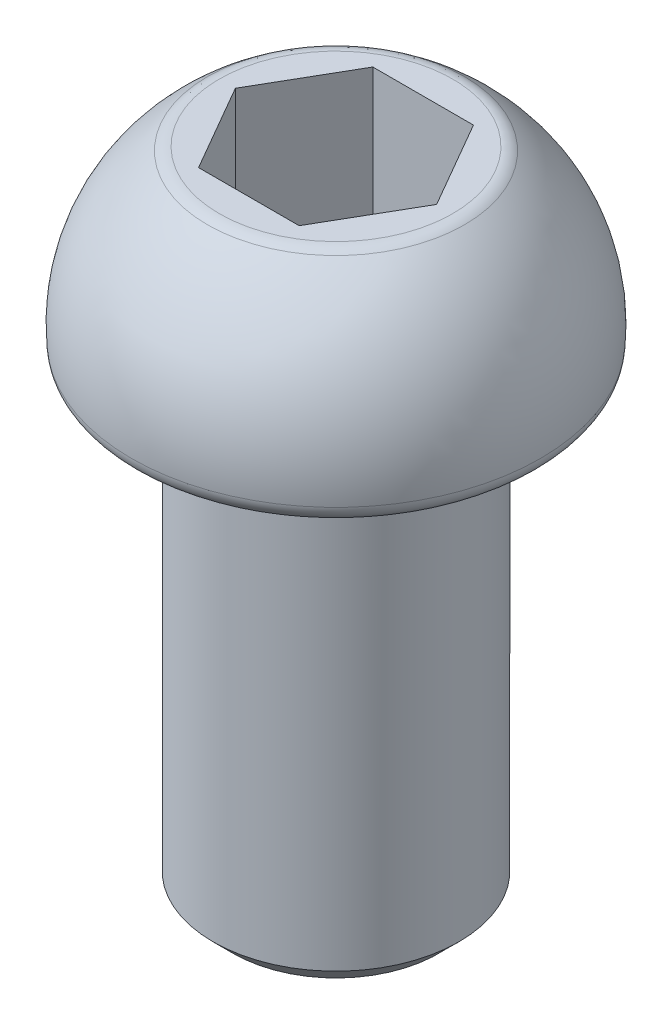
ISO-10303-21;
HEADER;
FILE_DESCRIPTION(('STEP AP214'),'2;1');
FILE_NAME('part.step','',(''),(''),'','','');
FILE_SCHEMA(('AUTOMOTIVE_DESIGN { 1 0 10303 214 1 1 1 1 }'));
ENDSEC;
DATA;
#1=APPLICATION_CONTEXT('core data for automotive mechanical design processes');
#2=APPLICATION_PROTOCOL_DEFINITION('international standard','automotive_design',2000,#1);
#3=PRODUCT_CONTEXT('',#1,'mechanical');
#4=PRODUCT('Part','Part','',(#3));
#5=PRODUCT_RELATED_PRODUCT_CATEGORY('part','',(#4));
#6=PRODUCT_DEFINITION_FORMATION('','',#4);
#7=PRODUCT_DEFINITION_CONTEXT('part definition',#1,'design');
#8=PRODUCT_DEFINITION('design','',#6,#7);
#9=PRODUCT_DEFINITION_SHAPE('','',#8);
#10=(LENGTH_UNIT() NAMED_UNIT(*) SI_UNIT(.MILLI.,.METRE.));
#11=(NAMED_UNIT(*) PLANE_ANGLE_UNIT() SI_UNIT($,.RADIAN.));
#12=(NAMED_UNIT(*) SI_UNIT($,.STERADIAN.) SOLID_ANGLE_UNIT());
#13=UNCERTAINTY_MEASURE_WITH_UNIT(LENGTH_MEASURE(1.E-05),#10,'distance_accuracy_value','');
#14=(GEOMETRIC_REPRESENTATION_CONTEXT(3) GLOBAL_UNCERTAINTY_ASSIGNED_CONTEXT((#13)) GLOBAL_UNIT_ASSIGNED_CONTEXT((#10,
#11,#12)) REPRESENTATION_CONTEXT('',''));
#15=CARTESIAN_POINT('',(0.,0.,0.));
#16=DIRECTION('',(0.,0.,1.));
#17=DIRECTION('',(1.,0.,0.));
#18=AXIS2_PLACEMENT_3D('',#15,#16,#17);
#19=CARTESIAN_POINT('',(336.886814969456,500.274983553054,0.));
#20=DIRECTION('',(0.,1.,0.));
#21=DIRECTION('',(0.,0.,1.));
#22=AXIS2_PLACEMENT_3D('',#19,#20,#21);
#23=PLANE('',#22);
#24=CARTESIAN_POINT('',(342.997157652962,500.274983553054,0.));
#25=DIRECTION('',(0.,1.,0.));
#26=DIRECTION('',(0.,0.,1.));
#27=AXIS2_PLACEMENT_3D('',#24,#25,#26);
#28=CIRCLE('',#27,5.79822934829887);
#29=CARTESIAN_POINT('',(342.997157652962,500.274983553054,5.79822934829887));
#30=VERTEX_POINT('',#29);
#31=EDGE_CURVE('E147',#30,#30,#28,.T.);
#32=ORIENTED_EDGE('',*,*,#31,.T.);
#33=EDGE_LOOP('',(#32));
#34=FACE_BOUND('',#33,.T.);
#35=DIRECTION('',(0.49999999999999,0.,-0.866025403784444));
#36=VECTOR('',#35,1.);
#37=CARTESIAN_POINT('',(345.497157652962,500.274983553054,4.33012701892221));
#38=LINE('',#37,#36);
#39=CARTESIAN_POINT('',(345.497157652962,500.274983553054,4.33012701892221));
#40=VERTEX_POINT('',#39);
#41=CARTESIAN_POINT('',(347.997157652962,500.274983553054,0.));
#42=VERTEX_POINT('',#41);
#43=EDGE_CURVE('E46',#40,#42,#38,.T.);
#44=ORIENTED_EDGE('',*,*,#43,.F.);
#45=DIRECTION('',(1.,0.,0.));
#46=VECTOR('',#45,1.);
#47=CARTESIAN_POINT('',(345.497157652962,500.274983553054,4.33012701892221));
#48=LINE('',#47,#46);
#49=CARTESIAN_POINT('',(340.497157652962,500.274983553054,4.33012701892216));
#50=VERTEX_POINT('',#49);
#51=EDGE_CURVE('E114',#50,#40,#48,.T.);
#52=ORIENTED_EDGE('',*,*,#51,.F.);
#53=DIRECTION('',(0.500000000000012,0.,0.866025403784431));
#54=VECTOR('',#53,1.);
#55=CARTESIAN_POINT('',(340.497157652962,500.274983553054,4.33012701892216));
#56=LINE('',#55,#54);
#57=CARTESIAN_POINT('',(337.997157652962,500.274983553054,1.04744500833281E-13));
#58=VERTEX_POINT('',#57);
#59=EDGE_CURVE('E108',#58,#50,#56,.T.);
#60=ORIENTED_EDGE('',*,*,#59,.F.);
#61=DIRECTION('',(-0.500000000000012,0.,0.866025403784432));
#62=VECTOR('',#61,1.);
#63=CARTESIAN_POINT('',(337.997157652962,500.274983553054,1.04744500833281E-13));
#64=LINE('',#63,#62);
#65=CARTESIAN_POINT('',(340.497157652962,500.274983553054,-4.33012701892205));
#66=VERTEX_POINT('',#65);
#67=EDGE_CURVE('E106',#66,#58,#64,.T.);
#68=ORIENTED_EDGE('',*,*,#67,.F.);
#69=DIRECTION('',(-1.,0.,0.));
#70=VECTOR('',#69,1.);
#71=CARTESIAN_POINT('',(340.497157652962,500.274983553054,-4.33012701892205));
#72=LINE('',#71,#70);
#73=CARTESIAN_POINT('',(345.497157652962,500.274983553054,-4.33012701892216));
#74=VERTEX_POINT('',#73);
#75=EDGE_CURVE('E89',#74,#66,#72,.T.);
#76=ORIENTED_EDGE('',*,*,#75,.F.);
#77=DIRECTION('',(-0.500000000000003,0.,-0.866025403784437));
#78=VECTOR('',#77,1.);
#79=CARTESIAN_POINT('',(347.997157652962,500.274983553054,0.));
#80=LINE('',#79,#78);
#81=EDGE_CURVE('E100',#42,#74,#80,.T.);
#82=ORIENTED_EDGE('',*,*,#81,.F.);
#83=EDGE_LOOP('',(#44,#52,#60,#68,#76,#82));
#84=FACE_BOUND('',#83,.T.);
#85=ADVANCED_FACE('F32',(#34,#84),#23,.T.);
#86=CARTESIAN_POINT('',(336.886814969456,468.095892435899,0.));
#87=DIRECTION('',(0.,-1.,0.));
#88=DIRECTION('',(0.,0.,-1.));
#89=AXIS2_PLACEMENT_3D('',#86,#87,#88);
#90=PLANE('',#89);
#91=CARTESIAN_POINT('',(342.997157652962,468.095892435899,0.));
#92=DIRECTION('',(0.,-1.,0.));
#93=DIRECTION('',(0.,0.,-1.));
#94=AXIS2_PLACEMENT_3D('',#91,#92,#93);
#95=CIRCLE('',#94,5.11034268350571);
#96=CARTESIAN_POINT('',(342.997157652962,468.095892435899,-5.11034268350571));
#97=VERTEX_POINT('',#96);
#98=EDGE_CURVE('E144',#97,#97,#95,.T.);
#99=ORIENTED_EDGE('',*,*,#98,.T.);
#100=EDGE_LOOP('',(#99));
#101=FACE_BOUND('',#100,.T.);
#102=ADVANCED_FACE('F171',(#101),#90,.T.);
#103=CARTESIAN_POINT('',(342.997157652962,500.274983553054,0.));
#104=DIRECTION('',(0.,1.,0.));
#105=DIRECTION('',(0.,0.,1.));
#106=AXIS2_PLACEMENT_3D('',#103,#104,#105);
#107=CYLINDRICAL_SURFACE('',#106,6.11034268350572);
#108=CARTESIAN_POINT('',(342.997157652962,469.095892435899,0.));
#109=DIRECTION('',(0.,-1.,0.));
#110=DIRECTION('',(0.,0.,-1.));
#111=AXIS2_PLACEMENT_3D('',#108,#109,#110);
#112=CIRCLE('',#111,6.11034268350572);
#113=CARTESIAN_POINT('',(342.997157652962,469.095892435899,-6.11034268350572));
#114=VERTEX_POINT('',#113);
#115=EDGE_CURVE('E141',#114,#114,#112,.F.);
#116=ORIENTED_EDGE('',*,*,#115,.T.);
#117=EDGE_LOOP('',(#116));
#118=FACE_BOUND('',#117,.T.);
#119=CARTESIAN_POINT('',(342.997157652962,491.002001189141,0.));
#120=DIRECTION('',(0.,1.,0.));
#121=DIRECTION('',(0.,0.,1.));
#122=AXIS2_PLACEMENT_3D('',#119,#120,#121);
#123=CIRCLE('',#122,6.11034268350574);
#124=CARTESIAN_POINT('',(342.997157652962,491.002001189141,6.11034268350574));
#125=VERTEX_POINT('',#124);
#126=EDGE_CURVE('E132',#125,#125,#123,.T.);
#127=ORIENTED_EDGE('',*,*,#126,.F.);
#128=EDGE_LOOP('',(#127));
#129=FACE_BOUND('',#128,.T.);
#130=ADVANCED_FACE('F176',(#118,#129),#107,.T.);
#131=CARTESIAN_POINT('',(336.886814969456,491.002001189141,0.));
#132=DIRECTION('',(0.,-1.,0.));
#133=DIRECTION('',(0.,0.,-1.));
#134=AXIS2_PLACEMENT_3D('',#131,#132,#133);
#135=PLANE('',#134);
#136=CARTESIAN_POINT('',(342.997157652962,491.002001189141,0.));
#137=DIRECTION('',(0.,-1.,0.));
#138=DIRECTION('',(0.,0.,-1.));
#139=AXIS2_PLACEMENT_3D('',#136,#137,#138);
#140=CIRCLE('',#139,9.1648415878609);
#141=CARTESIAN_POINT('',(342.997157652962,491.002001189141,-9.1648415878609));
#142=VERTEX_POINT('',#141);
#143=EDGE_CURVE('E11',#142,#142,#140,.T.);
#144=ORIENTED_EDGE('',*,*,#143,.T.);
#145=EDGE_LOOP('',(#144));
#146=FACE_BOUND('',#145,.T.);
#147=ORIENTED_EDGE('',*,*,#126,.T.);
#148=EDGE_LOOP('',(#147));
#149=FACE_BOUND('',#148,.T.);
#150=ADVANCED_FACE('F183',(#146,#149),#135,.T.);
#151=CARTESIAN_POINT('',(342.997157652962,492.654580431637,0.));
#152=DIRECTION('',(0.,1.,0.));
#153=DIRECTION('',(0.,0.,1.));
#154=AXIS2_PLACEMENT_3D('',#151,#152,#153);
#155=DEGENERATE_TOROIDAL_SURFACE('',#154,1.03531078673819,9.15568088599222,.T.);
#156=CARTESIAN_POINT('',(342.997157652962,491.921985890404,0.));
#157=DIRECTION('',(0.,1.,0.));
#158=DIRECTION('',(0.,0.,1.));
#159=AXIS2_PLACEMENT_3D('',#156,#157,#158);
#160=CIRCLE('',#159,10.1616352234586);
#161=CARTESIAN_POINT('',(342.997157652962,491.921985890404,10.1616352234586));
#162=VERTEX_POINT('',#161);
#163=EDGE_CURVE('E39',#162,#162,#160,.T.);
#164=ORIENTED_EDGE('',*,*,#163,.T.);
#165=EDGE_LOOP('',(#164));
#166=FACE_BOUND('',#165,.T.);
#167=CARTESIAN_POINT('',(342.997157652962,500.086737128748,0.));
#168=DIRECTION('',(0.,-1.,0.));
#169=DIRECTION('',(0.,0.,-1.));
#170=AXIS2_PLACEMENT_3D('',#167,#168,#169);
#171=CIRCLE('',#170,6.38222946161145);
#172=CARTESIAN_POINT('',(342.997157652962,500.086737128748,-6.38222946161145));
#173=VERTEX_POINT('',#172);
#174=EDGE_CURVE('E150',#173,#173,#171,.T.);
#175=ORIENTED_EDGE('',*,*,#174,.T.);
#176=EDGE_LOOP('',(#175));
#177=FACE_BOUND('',#176,.T.);
#178=ADVANCED_FACE('F155',(#166,#177),#155,.T.);
#179=CARTESIAN_POINT('',(342.997157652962,469.095892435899,0.));
#180=DIRECTION('',(0.,1.,0.));
#181=DIRECTION('',(0.,0.,1.));
#182=AXIS2_PLACEMENT_3D('',#179,#180,#181);
#183=CONICAL_SURFACE('',#182,6.11034268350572,0.785398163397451);
#184=ORIENTED_EDGE('',*,*,#98,.F.);
#185=EDGE_LOOP('',(#184));
#186=FACE_BOUND('',#185,.T.);
#187=ORIENTED_EDGE('',*,*,#115,.F.);
#188=EDGE_LOOP('',(#187));
#189=FACE_BOUND('',#188,.T.);
#190=ADVANCED_FACE('F192',(#186,#189),#183,.T.);
#191=CARTESIAN_POINT('',(345.497157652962,493.274983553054,4.33012701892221));
#192=DIRECTION('',(0.866025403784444,0.,0.49999999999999));
#193=DIRECTION('',(0.49999999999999,0.,-0.866025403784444));
#194=AXIS2_PLACEMENT_3D('',#191,#192,#193);
#195=PLANE('',#194);
#196=ORIENTED_EDGE('',*,*,#43,.T.);
#197=DIRECTION('',(0.,1.,0.));
#198=VECTOR('',#197,1.);
#199=CARTESIAN_POINT('',(347.997157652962,493.274983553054,0.));
#200=LINE('',#199,#198);
#201=CARTESIAN_POINT('',(347.997157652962,493.274983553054,0.));
#202=VERTEX_POINT('',#201);
#203=EDGE_CURVE('E97',#202,#42,#200,.T.);
#204=ORIENTED_EDGE('',*,*,#203,.F.);
#205=DIRECTION('',(0.49999999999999,0.,-0.866025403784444));
#206=VECTOR('',#205,1.);
#207=CARTESIAN_POINT('',(345.497157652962,493.274983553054,4.33012701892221));
#208=LINE('',#207,#206);
#209=CARTESIAN_POINT('',(345.497157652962,493.274983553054,4.33012701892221));
#210=VERTEX_POINT('',#209);
#211=EDGE_CURVE('E116',#210,#202,#208,.T.);
#212=ORIENTED_EDGE('',*,*,#211,.F.);
#213=DIRECTION('',(0.,1.,0.));
#214=VECTOR('',#213,1.);
#215=CARTESIAN_POINT('',(345.497157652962,493.274983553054,4.33012701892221));
#216=LINE('',#215,#214);
#217=EDGE_CURVE('E53',#210,#40,#216,.T.);
#218=ORIENTED_EDGE('',*,*,#217,.T.);
#219=EDGE_LOOP('',(#196,#204,#212,#218));
#220=FACE_BOUND('',#219,.T.);
#221=ADVANCED_FACE('F195',(#220),#195,.F.);
#222=CARTESIAN_POINT('',(345.497157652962,493.274983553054,4.33012701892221));
#223=DIRECTION('',(0.,0.,1.));
#224=DIRECTION('',(1.,0.,0.));
#225=AXIS2_PLACEMENT_3D('',#222,#223,#224);
#226=PLANE('',#225);
#227=ORIENTED_EDGE('',*,*,#51,.T.);
#228=ORIENTED_EDGE('',*,*,#217,.F.);
#229=DIRECTION('',(1.,0.,0.));
#230=VECTOR('',#229,1.);
#231=CARTESIAN_POINT('',(345.497157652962,493.274983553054,4.33012701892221));
#232=LINE('',#231,#230);
#233=CARTESIAN_POINT('',(340.497157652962,493.274983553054,4.33012701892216));
#234=VERTEX_POINT('',#233);
#235=EDGE_CURVE('E128',#234,#210,#232,.T.);
#236=ORIENTED_EDGE('',*,*,#235,.F.);
#237=DIRECTION('',(0.,1.,0.));
#238=VECTOR('',#237,1.);
#239=CARTESIAN_POINT('',(340.497157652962,493.274983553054,4.33012701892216));
#240=LINE('',#239,#238);
#241=EDGE_CURVE('E133',#234,#50,#240,.T.);
#242=ORIENTED_EDGE('',*,*,#241,.T.);
#243=EDGE_LOOP('',(#227,#228,#236,#242));
#244=FACE_BOUND('',#243,.T.);
#245=ADVANCED_FACE('F199',(#244),#226,.F.);
#246=CARTESIAN_POINT('',(340.497157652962,493.274983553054,4.33012701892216));
#247=DIRECTION('',(-0.866025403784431,0.,0.500000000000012));
#248=DIRECTION('',(0.500000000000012,0.,0.866025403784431));
#249=AXIS2_PLACEMENT_3D('',#246,#247,#248);
#250=PLANE('',#249);
#251=ORIENTED_EDGE('',*,*,#59,.T.);
#252=ORIENTED_EDGE('',*,*,#241,.F.);
#253=DIRECTION('',(0.500000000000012,0.,0.866025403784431));
#254=VECTOR('',#253,1.);
#255=CARTESIAN_POINT('',(340.497157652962,493.274983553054,4.33012701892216));
#256=LINE('',#255,#254);
#257=CARTESIAN_POINT('',(337.997157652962,493.274983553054,1.04744500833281E-13));
#258=VERTEX_POINT('',#257);
#259=EDGE_CURVE('E125',#258,#234,#256,.T.);
#260=ORIENTED_EDGE('',*,*,#259,.F.);
#261=DIRECTION('',(0.,1.,0.));
#262=VECTOR('',#261,1.);
#263=CARTESIAN_POINT('',(337.997157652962,493.274983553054,1.04744500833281E-13));
#264=LINE('',#263,#262);
#265=EDGE_CURVE('E135',#258,#58,#264,.T.);
#266=ORIENTED_EDGE('',*,*,#265,.T.);
#267=EDGE_LOOP('',(#251,#252,#260,#266));
#268=FACE_BOUND('',#267,.T.);
#269=ADVANCED_FACE('F207',(#268),#250,.F.);
#270=CARTESIAN_POINT('',(337.997157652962,493.274983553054,1.04744500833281E-13));
#271=DIRECTION('',(-0.866025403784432,0.,-0.500000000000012));
#272=DIRECTION('',(-0.500000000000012,0.,0.866025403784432));
#273=AXIS2_PLACEMENT_3D('',#270,#271,#272);
#274=PLANE('',#273);
#275=ORIENTED_EDGE('',*,*,#67,.T.);
#276=ORIENTED_EDGE('',*,*,#265,.F.);
#277=DIRECTION('',(-0.500000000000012,0.,0.866025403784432));
#278=VECTOR('',#277,1.);
#279=CARTESIAN_POINT('',(337.997157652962,493.274983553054,1.04744500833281E-13));
#280=LINE('',#279,#278);
#281=CARTESIAN_POINT('',(340.497157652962,493.274983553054,-4.33012701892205));
#282=VERTEX_POINT('',#281);
#283=EDGE_CURVE('E122',#282,#258,#280,.T.);
#284=ORIENTED_EDGE('',*,*,#283,.F.);
#285=DIRECTION('',(0.,1.,0.));
#286=VECTOR('',#285,1.);
#287=CARTESIAN_POINT('',(340.497157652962,493.274983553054,-4.33012701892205));
#288=LINE('',#287,#286);
#289=EDGE_CURVE('E96',#282,#66,#288,.T.);
#290=ORIENTED_EDGE('',*,*,#289,.T.);
#291=EDGE_LOOP('',(#275,#276,#284,#290));
#292=FACE_BOUND('',#291,.T.);
#293=ADVANCED_FACE('F204',(#292),#274,.F.);
#294=CARTESIAN_POINT('',(340.497157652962,493.274983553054,-4.33012701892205));
#295=DIRECTION('',(0.,0.,-1.));
#296=DIRECTION('',(-1.,0.,0.));
#297=AXIS2_PLACEMENT_3D('',#294,#295,#296);
#298=PLANE('',#297);
#299=ORIENTED_EDGE('',*,*,#75,.T.);
#300=ORIENTED_EDGE('',*,*,#289,.F.);
#301=DIRECTION('',(-1.,0.,0.));
#302=VECTOR('',#301,1.);
#303=CARTESIAN_POINT('',(340.497157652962,493.274983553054,-4.33012701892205));
#304=LINE('',#303,#302);
#305=CARTESIAN_POINT('',(345.497157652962,493.274983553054,-4.33012701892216));
#306=VERTEX_POINT('',#305);
#307=EDGE_CURVE('E92',#306,#282,#304,.T.);
#308=ORIENTED_EDGE('',*,*,#307,.F.);
#309=DIRECTION('',(0.,1.,0.));
#310=VECTOR('',#309,1.);
#311=CARTESIAN_POINT('',(345.497157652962,493.274983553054,-4.33012701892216));
#312=LINE('',#311,#310);
#313=EDGE_CURVE('E85',#306,#74,#312,.T.);
#314=ORIENTED_EDGE('',*,*,#313,.T.);
#315=EDGE_LOOP('',(#299,#300,#308,#314));
#316=FACE_BOUND('',#315,.T.);
#317=ADVANCED_FACE('F87',(#316),#298,.F.);
#318=CARTESIAN_POINT('',(347.997157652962,493.274983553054,0.));
#319=DIRECTION('',(0.866025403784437,0.,-0.500000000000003));
#320=DIRECTION('',(-0.500000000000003,0.,-0.866025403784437));
#321=AXIS2_PLACEMENT_3D('',#318,#319,#320);
#322=PLANE('',#321);
#323=ORIENTED_EDGE('',*,*,#81,.T.);
#324=ORIENTED_EDGE('',*,*,#313,.F.);
#325=DIRECTION('',(-0.500000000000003,0.,-0.866025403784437));
#326=VECTOR('',#325,1.);
#327=CARTESIAN_POINT('',(347.997157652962,493.274983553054,0.));
#328=LINE('',#327,#326);
#329=EDGE_CURVE('E119',#202,#306,#328,.T.);
#330=ORIENTED_EDGE('',*,*,#329,.F.);
#331=ORIENTED_EDGE('',*,*,#203,.T.);
#332=EDGE_LOOP('',(#323,#324,#330,#331));
#333=FACE_BOUND('',#332,.T.);
#334=ADVANCED_FACE('F101',(#333),#322,.F.);
#335=CARTESIAN_POINT('',(345.497157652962,493.274983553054,4.33012701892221));
#336=DIRECTION('',(0.,1.,0.));
#337=DIRECTION('',(0.,0.,1.));
#338=AXIS2_PLACEMENT_3D('',#335,#336,#337);
#339=PLANE('',#338);
#340=ORIENTED_EDGE('',*,*,#211,.T.);
#341=ORIENTED_EDGE('',*,*,#329,.T.);
#342=ORIENTED_EDGE('',*,*,#307,.T.);
#343=ORIENTED_EDGE('',*,*,#283,.T.);
#344=ORIENTED_EDGE('',*,*,#259,.T.);
#345=ORIENTED_EDGE('',*,*,#235,.T.);
#346=EDGE_LOOP('',(#340,#341,#342,#343,#344,#345));
#347=FACE_BOUND('',#346,.T.);
#348=ADVANCED_FACE('F166',(#347),#339,.T.);
#349=CARTESIAN_POINT('',(342.997157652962,499.274983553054,0.));
#350=DIRECTION('',(0.,1.,0.));
#351=DIRECTION('',(0.,0.,1.));
#352=AXIS2_PLACEMENT_3D('',#349,#350,#351);
#353=TOROIDAL_SURFACE('',#352,5.79822934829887,1.);
#354=ORIENTED_EDGE('',*,*,#174,.F.);
#355=EDGE_LOOP('',(#354));
#356=FACE_BOUND('',#355,.T.);
#357=ORIENTED_EDGE('',*,*,#31,.F.);
#358=EDGE_LOOP('',(#357));
#359=FACE_BOUND('',#358,.T.);
#360=ADVANCED_FACE('F160',(#356,#359),#353,.T.);
#361=CARTESIAN_POINT('',(342.997157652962,492.002001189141,0.));
#362=DIRECTION('',(0.,-1.,0.));
#363=DIRECTION('',(0.,0.,-1.));
#364=AXIS2_PLACEMENT_3D('',#361,#362,#363);
#365=TOROIDAL_SURFACE('',#364,9.1648415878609,1.);
#366=ORIENTED_EDGE('',*,*,#143,.F.);
#367=EDGE_LOOP('',(#366));
#368=FACE_BOUND('',#367,.T.);
#369=ORIENTED_EDGE('',*,*,#163,.F.);
#370=EDGE_LOOP('',(#369));
#371=FACE_BOUND('',#370,.T.);
#372=ADVANCED_FACE('F158',(#368,#371),#365,.T.);
#373=CLOSED_SHELL('',(#85,#102,#130,#150,#178,#190,#221,#245,#269,#293,#317,#334,#348,#360,#372));
#374=MANIFOLD_SOLID_BREP('B2',#373);
#375=ADVANCED_BREP_SHAPE_REPRESENTATION('',(#18,#374),#14);
#376=SHAPE_DEFINITION_REPRESENTATION(#9,#375);
ENDSEC;
END-ISO-10303-21;
